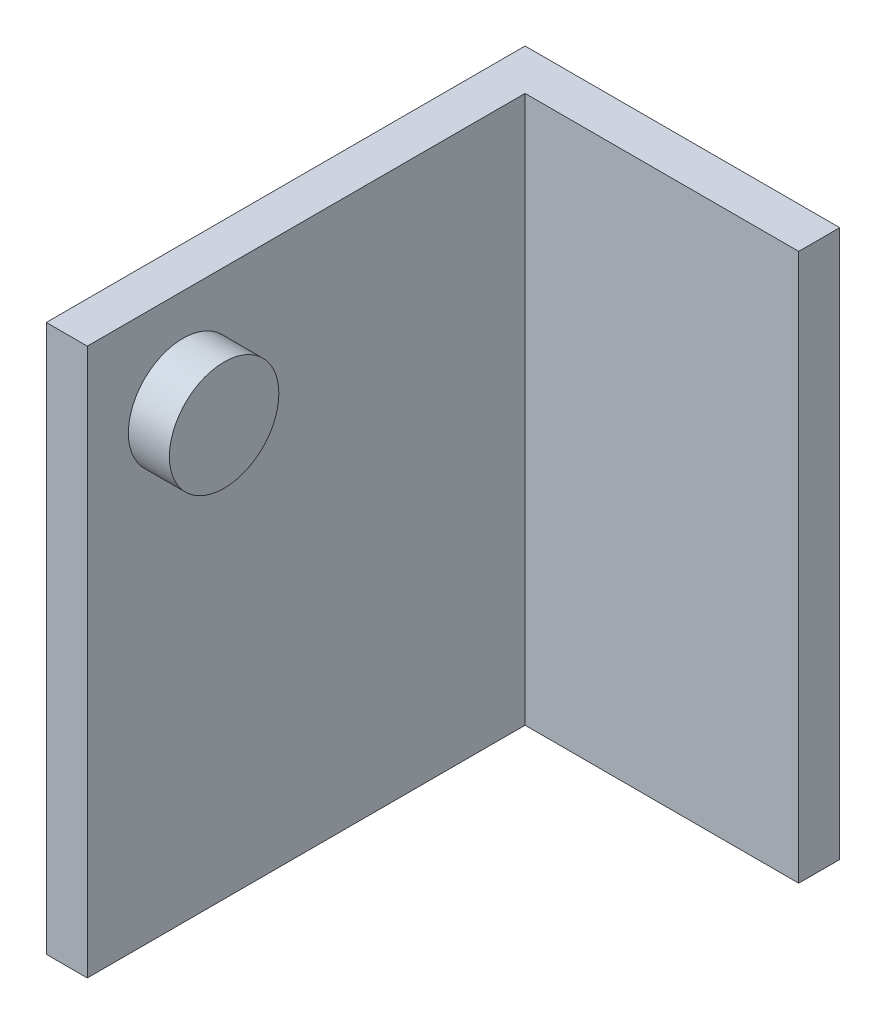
ISO-10303-21;
HEADER;
FILE_DESCRIPTION(('STEP AP214'),'2;1');
FILE_NAME('part.step','',(''),(''),'','','');
FILE_SCHEMA(('AUTOMOTIVE_DESIGN { 1 0 10303 214 1 1 1 1 }'));
ENDSEC;
DATA;
#1=APPLICATION_CONTEXT('core data for automotive mechanical design processes');
#2=APPLICATION_PROTOCOL_DEFINITION('international standard','automotive_design',2000,#1);
#3=PRODUCT_CONTEXT('',#1,'mechanical');
#4=PRODUCT('Part','Part','',(#3));
#5=PRODUCT_RELATED_PRODUCT_CATEGORY('part','',(#4));
#6=PRODUCT_DEFINITION_FORMATION('','',#4);
#7=PRODUCT_DEFINITION_CONTEXT('part definition',#1,'design');
#8=PRODUCT_DEFINITION('design','',#6,#7);
#9=PRODUCT_DEFINITION_SHAPE('','',#8);
#10=(LENGTH_UNIT() NAMED_UNIT(*) SI_UNIT(.MILLI.,.METRE.));
#11=(NAMED_UNIT(*) PLANE_ANGLE_UNIT() SI_UNIT($,.RADIAN.));
#12=(NAMED_UNIT(*) SI_UNIT($,.STERADIAN.) SOLID_ANGLE_UNIT());
#13=UNCERTAINTY_MEASURE_WITH_UNIT(LENGTH_MEASURE(1.E-05),#10,'distance_accuracy_value','');
#14=(GEOMETRIC_REPRESENTATION_CONTEXT(3) GLOBAL_UNCERTAINTY_ASSIGNED_CONTEXT((#13)) GLOBAL_UNIT_ASSIGNED_CONTEXT((#10,
#11,#12)) REPRESENTATION_CONTEXT('',''));
#15=CARTESIAN_POINT('',(0.,0.,0.));
#16=DIRECTION('',(0.,0.,1.));
#17=DIRECTION('',(1.,0.,0.));
#18=AXIS2_PLACEMENT_3D('',#15,#16,#17);
#19=CARTESIAN_POINT('',(-38.,0.,25.5));
#20=DIRECTION('',(1.,0.,0.));
#21=DIRECTION('',(0.,0.,-1.));
#22=AXIS2_PLACEMENT_3D('',#19,#20,#21);
#23=PLANE('',#22);
#24=DIRECTION('',(0.,-1.,0.));
#25=VECTOR('',#24,1.);
#26=CARTESIAN_POINT('',(-38.,0.,22.5));
#27=LINE('',#26,#25);
#28=CARTESIAN_POINT('',(-38.,94.,22.5));
#29=VERTEX_POINT('',#28);
#30=CARTESIAN_POINT('',(-38.,54.,22.5));
#31=VERTEX_POINT('',#30);
#32=EDGE_CURVE('E78',#29,#31,#27,.T.);
#33=ORIENTED_EDGE('',*,*,#32,.F.);
#34=DIRECTION('',(0.,0.,-1.));
#35=VECTOR('',#34,1.);
#36=CARTESIAN_POINT('',(-38.,94.,25.5));
#37=LINE('',#36,#35);
#38=CARTESIAN_POINT('',(-38.,94.,25.5));
#39=VERTEX_POINT('',#38);
#40=EDGE_CURVE('E110',#39,#29,#37,.T.);
#41=ORIENTED_EDGE('',*,*,#40,.F.);
#42=DIRECTION('',(0.,-1.,0.));
#43=VECTOR('',#42,1.);
#44=CARTESIAN_POINT('',(-38.,0.,25.5));
#45=LINE('',#44,#43);
#46=CARTESIAN_POINT('',(-38.,54.,25.5));
#47=VERTEX_POINT('',#46);
#48=EDGE_CURVE('E80',#39,#47,#45,.T.);
#49=ORIENTED_EDGE('',*,*,#48,.T.);
#50=DIRECTION('',(0.,0.,-1.));
#51=VECTOR('',#50,1.);
#52=CARTESIAN_POINT('',(-38.,54.,25.5));
#53=LINE('',#52,#51);
#54=EDGE_CURVE('E74',#47,#31,#53,.T.);
#55=ORIENTED_EDGE('',*,*,#54,.T.);
#56=EDGE_LOOP('',(#33,#41,#49,#55));
#57=FACE_BOUND('',#56,.T.);
#58=ADVANCED_FACE('F35',(#57),#23,.T.);
#59=CARTESIAN_POINT('',(0.,94.,25.5));
#60=DIRECTION('',(0.,1.,0.));
#61=DIRECTION('',(0.,0.,1.));
#62=AXIS2_PLACEMENT_3D('',#59,#60,#61);
#63=PLANE('',#62);
#64=DIRECTION('',(1.,0.,0.));
#65=VECTOR('',#64,1.);
#66=CARTESIAN_POINT('',(0.,94.,22.5));
#67=LINE('',#66,#65);
#68=CARTESIAN_POINT('',(-61.,94.,22.5));
#69=VERTEX_POINT('',#68);
#70=EDGE_CURVE('E96',#69,#29,#67,.T.);
#71=ORIENTED_EDGE('',*,*,#70,.F.);
#72=DIRECTION('',(0.,0.,-1.));
#73=VECTOR('',#72,1.);
#74=CARTESIAN_POINT('',(-61.,94.,25.5));
#75=LINE('',#74,#73);
#76=CARTESIAN_POINT('',(-61.,94.,57.5));
#77=VERTEX_POINT('',#76);
#78=EDGE_CURVE('E108',#77,#69,#75,.T.);
#79=ORIENTED_EDGE('',*,*,#78,.F.);
#80=DIRECTION('',(-1.,0.,0.));
#81=VECTOR('',#80,1.);
#82=CARTESIAN_POINT('',(-61.,94.,57.5));
#83=LINE('',#82,#81);
#84=CARTESIAN_POINT('',(-58.,94.,57.5));
#85=VERTEX_POINT('',#84);
#86=EDGE_CURVE('E134',#85,#77,#83,.T.);
#87=ORIENTED_EDGE('',*,*,#86,.F.);
#88=DIRECTION('',(0.,0.,-1.));
#89=VECTOR('',#88,1.);
#90=CARTESIAN_POINT('',(-58.,94.,57.5));
#91=LINE('',#90,#89);
#92=CARTESIAN_POINT('',(-58.,94.,25.5));
#93=VERTEX_POINT('',#92);
#94=EDGE_CURVE('E101',#85,#93,#91,.T.);
#95=ORIENTED_EDGE('',*,*,#94,.T.);
#96=DIRECTION('',(1.,0.,0.));
#97=VECTOR('',#96,1.);
#98=CARTESIAN_POINT('',(0.,94.,25.5));
#99=LINE('',#98,#97);
#100=EDGE_CURVE('E128',#93,#39,#99,.T.);
#101=ORIENTED_EDGE('',*,*,#100,.T.);
#102=ORIENTED_EDGE('',*,*,#40,.T.);
#103=EDGE_LOOP('',(#71,#79,#87,#95,#101,#102));
#104=FACE_BOUND('',#103,.T.);
#105=ADVANCED_FACE('F119',(#104),#63,.T.);
#106=CARTESIAN_POINT('',(-61.,0.,25.5));
#107=DIRECTION('',(1.,0.,0.));
#108=DIRECTION('',(0.,1.,0.));
#109=AXIS2_PLACEMENT_3D('',#106,#107,#108);
#110=PLANE('',#109);
#111=CARTESIAN_POINT('',(-61.,87.,50.5));
#112=DIRECTION('',(1.,0.,0.));
#113=DIRECTION('',(0.,1.,0.));
#114=AXIS2_PLACEMENT_3D('',#111,#112,#113);
#115=CIRCLE('',#114,4.00000000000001);
#116=CARTESIAN_POINT('',(-61.,91.,50.5));
#117=VERTEX_POINT('',#116);
#118=EDGE_CURVE('E42',#117,#117,#115,.F.);
#119=ORIENTED_EDGE('',*,*,#118,.F.);
#120=EDGE_LOOP('',(#119));
#121=FACE_BOUND('',#120,.T.);
#122=DIRECTION('',(0.,-1.,0.));
#123=VECTOR('',#122,1.);
#124=CARTESIAN_POINT('',(-61.,0.,22.5));
#125=LINE('',#124,#123);
#126=CARTESIAN_POINT('',(-61.,54.,22.5));
#127=VERTEX_POINT('',#126);
#128=EDGE_CURVE('E92',#69,#127,#125,.T.);
#129=ORIENTED_EDGE('',*,*,#128,.T.);
#130=DIRECTION('',(0.,0.,-1.));
#131=VECTOR('',#130,1.);
#132=CARTESIAN_POINT('',(-61.,54.,25.5));
#133=LINE('',#132,#131);
#134=CARTESIAN_POINT('',(-61.,54.,57.5));
#135=VERTEX_POINT('',#134);
#136=EDGE_CURVE('E82',#135,#127,#133,.T.);
#137=ORIENTED_EDGE('',*,*,#136,.F.);
#138=DIRECTION('',(0.,-1.,0.));
#139=VECTOR('',#138,1.);
#140=CARTESIAN_POINT('',(-61.,94.,57.5));
#141=LINE('',#140,#139);
#142=EDGE_CURVE('E136',#77,#135,#141,.T.);
#143=ORIENTED_EDGE('',*,*,#142,.F.);
#144=ORIENTED_EDGE('',*,*,#78,.T.);
#145=EDGE_LOOP('',(#129,#137,#143,#144));
#146=FACE_BOUND('',#145,.T.);
#147=ADVANCED_FACE('F116',(#121,#146),#110,.F.);
#148=CARTESIAN_POINT('',(0.,54.,25.5));
#149=DIRECTION('',(0.,1.,0.));
#150=DIRECTION('',(0.,0.,1.));
#151=AXIS2_PLACEMENT_3D('',#148,#149,#150);
#152=PLANE('',#151);
#153=DIRECTION('',(1.,0.,0.));
#154=VECTOR('',#153,1.);
#155=CARTESIAN_POINT('',(0.,54.,22.5));
#156=LINE('',#155,#154);
#157=EDGE_CURVE('E86',#127,#31,#156,.T.);
#158=ORIENTED_EDGE('',*,*,#157,.T.);
#159=ORIENTED_EDGE('',*,*,#54,.F.);
#160=DIRECTION('',(1.,0.,0.));
#161=VECTOR('',#160,1.);
#162=CARTESIAN_POINT('',(0.,54.,25.5));
#163=LINE('',#162,#161);
#164=CARTESIAN_POINT('',(-58.,54.,25.5));
#165=VERTEX_POINT('',#164);
#166=EDGE_CURVE('E54',#165,#47,#163,.T.);
#167=ORIENTED_EDGE('',*,*,#166,.F.);
#168=DIRECTION('',(0.,0.,-1.));
#169=VECTOR('',#168,1.);
#170=CARTESIAN_POINT('',(-58.,54.,57.5));
#171=LINE('',#170,#169);
#172=CARTESIAN_POINT('',(-58.,54.,57.5));
#173=VERTEX_POINT('',#172);
#174=EDGE_CURVE('E97',#173,#165,#171,.T.);
#175=ORIENTED_EDGE('',*,*,#174,.F.);
#176=DIRECTION('',(1.,0.,0.));
#177=VECTOR('',#176,1.);
#178=CARTESIAN_POINT('',(-61.,54.,57.5));
#179=LINE('',#178,#177);
#180=EDGE_CURVE('E142',#135,#173,#179,.T.);
#181=ORIENTED_EDGE('',*,*,#180,.F.);
#182=ORIENTED_EDGE('',*,*,#136,.T.);
#183=EDGE_LOOP('',(#158,#159,#167,#175,#181,#182));
#184=FACE_BOUND('',#183,.T.);
#185=ADVANCED_FACE('F87',(#184),#152,.F.);
#186=CARTESIAN_POINT('',(0.,0.,25.5));
#187=DIRECTION('',(0.,0.,1.));
#188=DIRECTION('',(1.,0.,0.));
#189=AXIS2_PLACEMENT_3D('',#186,#187,#188);
#190=PLANE('',#189);
#191=DIRECTION('',(0.,1.,0.));
#192=VECTOR('',#191,1.);
#193=CARTESIAN_POINT('',(-58.,94.,25.5));
#194=LINE('',#193,#192);
#195=EDGE_CURVE('E49',#165,#93,#194,.T.);
#196=ORIENTED_EDGE('',*,*,#195,.F.);
#197=ORIENTED_EDGE('',*,*,#166,.T.);
#198=ORIENTED_EDGE('',*,*,#48,.F.);
#199=ORIENTED_EDGE('',*,*,#100,.F.);
#200=EDGE_LOOP('',(#196,#197,#198,#199));
#201=FACE_BOUND('',#200,.T.);
#202=ADVANCED_FACE('F129',(#201),#190,.T.);
#203=CARTESIAN_POINT('',(0.,0.,22.5));
#204=DIRECTION('',(0.,0.,1.));
#205=DIRECTION('',(1.,0.,0.));
#206=AXIS2_PLACEMENT_3D('',#203,#204,#205);
#207=PLANE('',#206);
#208=ORIENTED_EDGE('',*,*,#32,.T.);
#209=ORIENTED_EDGE('',*,*,#157,.F.);
#210=ORIENTED_EDGE('',*,*,#128,.F.);
#211=ORIENTED_EDGE('',*,*,#70,.T.);
#212=EDGE_LOOP('',(#208,#209,#210,#211));
#213=FACE_BOUND('',#212,.T.);
#214=ADVANCED_FACE('F94',(#213),#207,.F.);
#215=CARTESIAN_POINT('',(-58.,94.,57.5));
#216=DIRECTION('',(-1.,0.,0.));
#217=DIRECTION('',(0.,-1.,0.));
#218=AXIS2_PLACEMENT_3D('',#215,#216,#217);
#219=PLANE('',#218);
#220=CARTESIAN_POINT('',(-58.,87.,50.5));
#221=DIRECTION('',(-1.,0.,0.));
#222=DIRECTION('',(0.,-1.,0.));
#223=AXIS2_PLACEMENT_3D('',#220,#221,#222);
#224=CIRCLE('',#223,4.00000000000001);
#225=CARTESIAN_POINT('',(-58.,83.,50.5));
#226=VERTEX_POINT('',#225);
#227=EDGE_CURVE('E11',#226,#226,#224,.F.);
#228=ORIENTED_EDGE('',*,*,#227,.F.);
#229=EDGE_LOOP('',(#228));
#230=FACE_BOUND('',#229,.T.);
#231=ORIENTED_EDGE('',*,*,#195,.T.);
#232=ORIENTED_EDGE('',*,*,#94,.F.);
#233=DIRECTION('',(0.,1.,0.));
#234=VECTOR('',#233,1.);
#235=CARTESIAN_POINT('',(-58.,94.,57.5));
#236=LINE('',#235,#234);
#237=EDGE_CURVE('E139',#173,#85,#236,.T.);
#238=ORIENTED_EDGE('',*,*,#237,.F.);
#239=ORIENTED_EDGE('',*,*,#174,.T.);
#240=EDGE_LOOP('',(#231,#232,#238,#239));
#241=FACE_BOUND('',#240,.T.);
#242=ADVANCED_FACE('F162',(#230,#241),#219,.F.);
#243=CARTESIAN_POINT('',(0.,0.,57.5));
#244=DIRECTION('',(0.,0.,1.));
#245=DIRECTION('',(1.,0.,0.));
#246=AXIS2_PLACEMENT_3D('',#243,#244,#245);
#247=PLANE('',#246);
#248=ORIENTED_EDGE('',*,*,#142,.T.);
#249=ORIENTED_EDGE('',*,*,#180,.T.);
#250=ORIENTED_EDGE('',*,*,#237,.T.);
#251=ORIENTED_EDGE('',*,*,#86,.T.);
#252=EDGE_LOOP('',(#248,#249,#250,#251));
#253=FACE_BOUND('',#252,.T.);
#254=ADVANCED_FACE('F165',(#253),#247,.T.);
#255=CARTESIAN_POINT('',(-64.,87.,50.5));
#256=DIRECTION('',(1.,0.,0.));
#257=DIRECTION('',(0.,0.,-1.));
#258=AXIS2_PLACEMENT_3D('',#255,#256,#257);
#259=CYLINDRICAL_SURFACE('',#258,4.00000000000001);
#260=CARTESIAN_POINT('',(-64.,87.,50.5));
#261=DIRECTION('',(-1.,0.,0.));
#262=DIRECTION('',(0.,0.,1.));
#263=AXIS2_PLACEMENT_3D('',#260,#261,#262);
#264=CIRCLE('',#263,4.00000000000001);
#265=CARTESIAN_POINT('',(-64.,87.,54.5));
#266=VERTEX_POINT('',#265);
#267=EDGE_CURVE('E137',#266,#266,#264,.T.);
#268=ORIENTED_EDGE('',*,*,#267,.F.);
#269=EDGE_LOOP('',(#268));
#270=FACE_BOUND('',#269,.T.);
#271=ORIENTED_EDGE('',*,*,#118,.T.);
#272=EDGE_LOOP('',(#271));
#273=FACE_BOUND('',#272,.T.);
#274=ADVANCED_FACE('F114',(#270,#273),#259,.T.);
#275=CARTESIAN_POINT('',(-64.,87.,50.5));
#276=DIRECTION('',(-1.,0.,0.));
#277=DIRECTION('',(0.,0.,1.));
#278=AXIS2_PLACEMENT_3D('',#275,#276,#277);
#279=PLANE('',#278);
#280=ORIENTED_EDGE('',*,*,#267,.T.);
#281=EDGE_LOOP('',(#280));
#282=FACE_BOUND('',#281,.T.);
#283=ADVANCED_FACE('F158',(#282),#279,.T.);
#284=CARTESIAN_POINT('',(-55.,87.,50.5));
#285=DIRECTION('',(-1.,0.,0.));
#286=DIRECTION('',(0.,-1.,0.));
#287=AXIS2_PLACEMENT_3D('',#284,#285,#286);
#288=CYLINDRICAL_SURFACE('',#287,4.00000000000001);
#289=CARTESIAN_POINT('',(-55.,87.,50.5));
#290=DIRECTION('',(1.,0.,0.));
#291=DIRECTION('',(0.,1.,0.));
#292=AXIS2_PLACEMENT_3D('',#289,#290,#291);
#293=CIRCLE('',#292,4.00000000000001);
#294=CARTESIAN_POINT('',(-55.,91.,50.5));
#295=VERTEX_POINT('',#294);
#296=EDGE_CURVE('E149',#295,#295,#293,.T.);
#297=ORIENTED_EDGE('',*,*,#296,.F.);
#298=EDGE_LOOP('',(#297));
#299=FACE_BOUND('',#298,.T.);
#300=ORIENTED_EDGE('',*,*,#227,.T.);
#301=EDGE_LOOP('',(#300));
#302=FACE_BOUND('',#301,.T.);
#303=ADVANCED_FACE('F155',(#299,#302),#288,.T.);
#304=CARTESIAN_POINT('',(-55.,87.,50.5));
#305=DIRECTION('',(1.,0.,0.));
#306=DIRECTION('',(0.,1.,0.));
#307=AXIS2_PLACEMENT_3D('',#304,#305,#306);
#308=PLANE('',#307);
#309=ORIENTED_EDGE('',*,*,#296,.T.);
#310=EDGE_LOOP('',(#309));
#311=FACE_BOUND('',#310,.T.);
#312=ADVANCED_FACE('F153',(#311),#308,.T.);
#313=CLOSED_SHELL('',(#58,#105,#147,#185,#202,#214,#242,#254,#274,#283,#303,#312));
#314=MANIFOLD_SOLID_BREP('B2',#313);
#315=ADVANCED_BREP_SHAPE_REPRESENTATION('',(#18,#314),#14);
#316=SHAPE_DEFINITION_REPRESENTATION(#9,#315);
ENDSEC;
END-ISO-10303-21;
